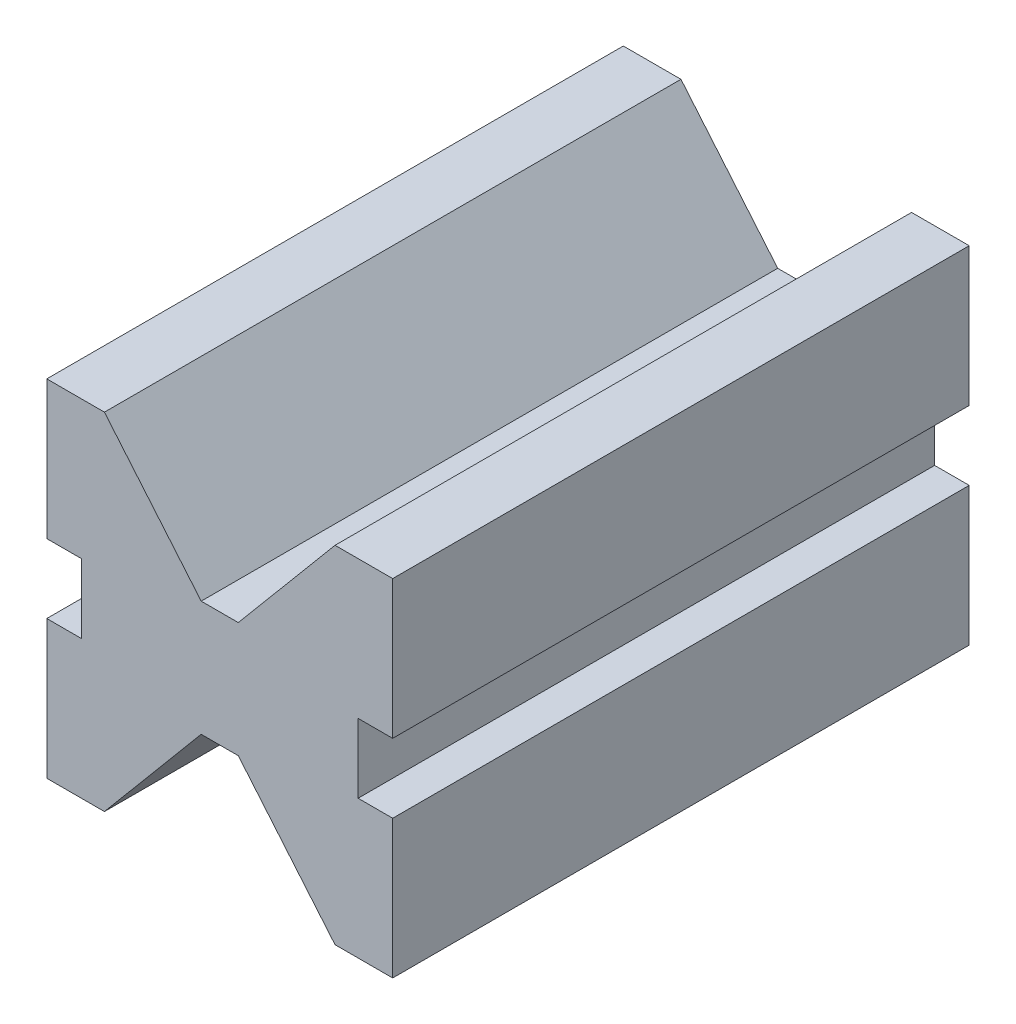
from build123d import *

# Parameters (mm, degrees)
BOSS_EXTRUDE1_DEPTH = 100


with BuildPart() as part:
    # Sketch1 → Boss-Extrude1 (new body)
    with BuildSketch(Plane.XY):
        Polygon((0, 0), (3.218007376, 0), (20, -20), (30, -20), (30, 4), (24, 4), (24, 16), (30, 16), (30, 40), (20, 40), (3.218007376, 20), (0, 20), align=None)
    boss_extrude1 = extrude(amount=BOSS_EXTRUDE1_DEPTH)

    # Mirror1: Boss-Extrude1 across plane
    add(boss_extrude1.mirror(Plane(origin=(0, 20, 100), x_dir=(0, 0, 1), z_dir=(1, 0, 0))))


solid = part.part
